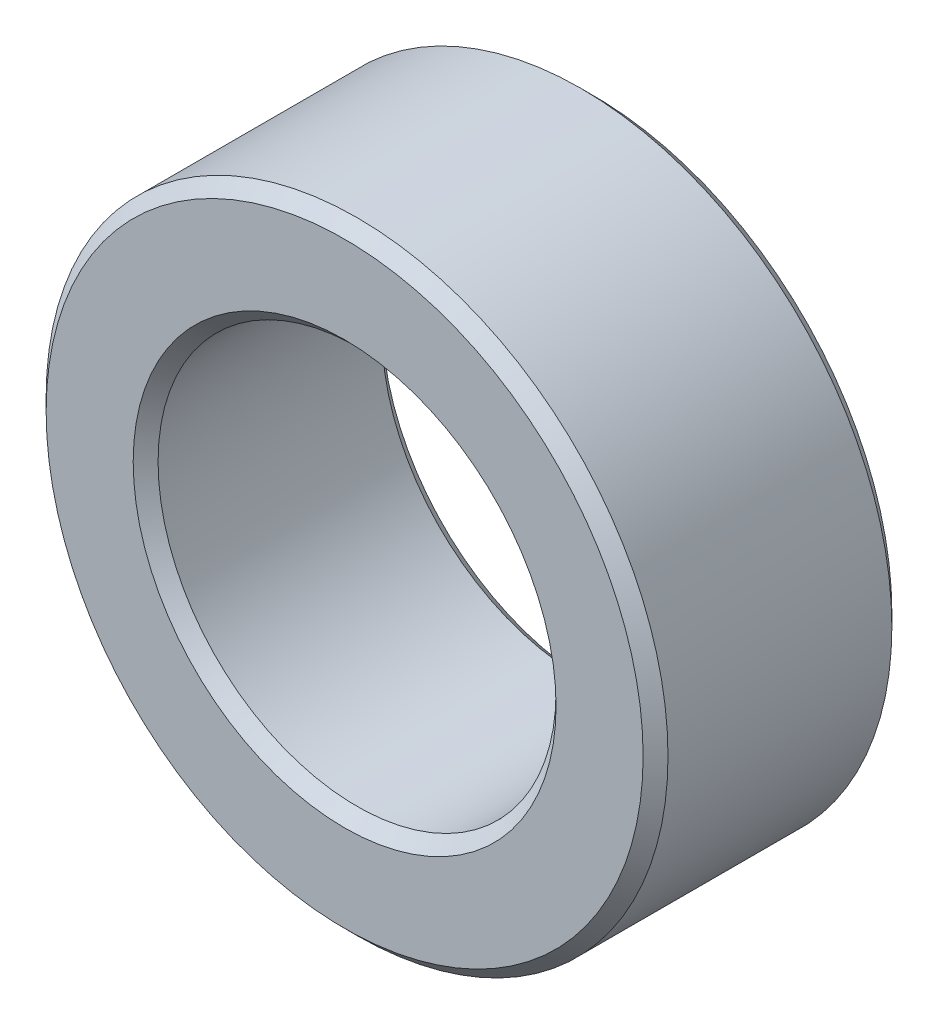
ISO-10303-21;
HEADER;
FILE_DESCRIPTION(('STEP AP214'),'2;1');
FILE_NAME('part.step','',(''),(''),'','','');
FILE_SCHEMA(('AUTOMOTIVE_DESIGN { 1 0 10303 214 1 1 1 1 }'));
ENDSEC;
DATA;
#1=APPLICATION_CONTEXT('core data for automotive mechanical design processes');
#2=APPLICATION_PROTOCOL_DEFINITION('international standard','automotive_design',2000,#1);
#3=PRODUCT_CONTEXT('',#1,'mechanical');
#4=PRODUCT('Part','Part','',(#3));
#5=PRODUCT_RELATED_PRODUCT_CATEGORY('part','',(#4));
#6=PRODUCT_DEFINITION_FORMATION('','',#4);
#7=PRODUCT_DEFINITION_CONTEXT('part definition',#1,'design');
#8=PRODUCT_DEFINITION('design','',#6,#7);
#9=PRODUCT_DEFINITION_SHAPE('','',#8);
#10=(LENGTH_UNIT() NAMED_UNIT(*) SI_UNIT(.MILLI.,.METRE.));
#11=(NAMED_UNIT(*) PLANE_ANGLE_UNIT() SI_UNIT($,.RADIAN.));
#12=(NAMED_UNIT(*) SI_UNIT($,.STERADIAN.) SOLID_ANGLE_UNIT());
#13=UNCERTAINTY_MEASURE_WITH_UNIT(LENGTH_MEASURE(1.E-05),#10,'distance_accuracy_value','');
#14=(GEOMETRIC_REPRESENTATION_CONTEXT(3) GLOBAL_UNCERTAINTY_ASSIGNED_CONTEXT((#13)) GLOBAL_UNIT_ASSIGNED_CONTEXT((#10,
#11,#12)) REPRESENTATION_CONTEXT('',''));
#15=CARTESIAN_POINT('',(0.,0.,0.));
#16=DIRECTION('',(0.,0.,1.));
#17=DIRECTION('',(1.,0.,0.));
#18=AXIS2_PLACEMENT_3D('',#15,#16,#17);
#19=CARTESIAN_POINT('',(0.,0.,2.));
#20=DIRECTION('',(0.,0.,1.));
#21=DIRECTION('',(1.,0.,0.));
#22=AXIS2_PLACEMENT_3D('',#19,#20,#21);
#23=PLANE('',#22);
#24=CARTESIAN_POINT('',(0.,0.,2.));
#25=DIRECTION('',(0.,0.,1.));
#26=DIRECTION('',(1.,0.,0.));
#27=AXIS2_PLACEMENT_3D('',#24,#25,#26);
#28=CIRCLE('',#27,3.4);
#29=CARTESIAN_POINT('',(3.4,0.,2.));
#30=VERTEX_POINT('',#29);
#31=EDGE_CURVE('E10',#30,#30,#28,.F.);
#32=ORIENTED_EDGE('',*,*,#31,.T.);
#33=EDGE_LOOP('',(#32));
#34=FACE_BOUND('',#33,.T.);
#35=CARTESIAN_POINT('',(0.,0.,2.));
#36=DIRECTION('',(0.,0.,1.));
#37=DIRECTION('',(1.,0.,0.));
#38=AXIS2_PLACEMENT_3D('',#35,#36,#37);
#39=CIRCLE('',#38,4.8);
#40=CARTESIAN_POINT('',(4.8,0.,2.));
#41=VERTEX_POINT('',#40);
#42=EDGE_CURVE('E45',#41,#41,#39,.T.);
#43=ORIENTED_EDGE('',*,*,#42,.T.);
#44=EDGE_LOOP('',(#43));
#45=FACE_BOUND('',#44,.T.);
#46=ADVANCED_FACE('F37',(#34,#45),#23,.T.);
#47=CARTESIAN_POINT('',(0.,0.,-2.));
#48=DIRECTION('',(0.,0.,1.));
#49=DIRECTION('',(1.,0.,0.));
#50=AXIS2_PLACEMENT_3D('',#47,#48,#49);
#51=PLANE('',#50);
#52=CARTESIAN_POINT('',(0.,0.,-2.));
#53=DIRECTION('',(0.,0.,1.));
#54=DIRECTION('',(1.,0.,0.));
#55=AXIS2_PLACEMENT_3D('',#52,#53,#54);
#56=CIRCLE('',#55,4.8);
#57=CARTESIAN_POINT('',(4.8,0.,-2.));
#58=VERTEX_POINT('',#57);
#59=EDGE_CURVE('E64',#58,#58,#56,.F.);
#60=ORIENTED_EDGE('',*,*,#59,.T.);
#61=EDGE_LOOP('',(#60));
#62=FACE_BOUND('',#61,.T.);
#63=CARTESIAN_POINT('',(0.,0.,-2.));
#64=DIRECTION('',(0.,0.,1.));
#65=DIRECTION('',(1.,0.,0.));
#66=AXIS2_PLACEMENT_3D('',#63,#64,#65);
#67=CIRCLE('',#66,3.4);
#68=CARTESIAN_POINT('',(3.4,0.,-2.));
#69=VERTEX_POINT('',#68);
#70=EDGE_CURVE('E67',#69,#69,#67,.T.);
#71=ORIENTED_EDGE('',*,*,#70,.T.);
#72=EDGE_LOOP('',(#71));
#73=FACE_BOUND('',#72,.T.);
#74=ADVANCED_FACE('F89',(#62,#73),#51,.F.);
#75=CARTESIAN_POINT('',(0.,0.,2.));
#76=DIRECTION('',(0.,0.,-1.));
#77=DIRECTION('',(-1.,0.,0.));
#78=AXIS2_PLACEMENT_3D('',#75,#76,#77);
#79=CYLINDRICAL_SURFACE('',#78,5.);
#80=CARTESIAN_POINT('',(0.,0.,-1.8));
#81=DIRECTION('',(0.,0.,1.));
#82=DIRECTION('',(1.,0.,0.));
#83=AXIS2_PLACEMENT_3D('',#80,#81,#82);
#84=CIRCLE('',#83,5.);
#85=CARTESIAN_POINT('',(5.,0.,-1.8));
#86=VERTEX_POINT('',#85);
#87=EDGE_CURVE('E71',#86,#86,#84,.T.);
#88=ORIENTED_EDGE('',*,*,#87,.T.);
#89=EDGE_LOOP('',(#88));
#90=FACE_BOUND('',#89,.T.);
#91=CARTESIAN_POINT('',(0.,0.,1.8));
#92=DIRECTION('',(0.,0.,1.));
#93=DIRECTION('',(1.,0.,0.));
#94=AXIS2_PLACEMENT_3D('',#91,#92,#93);
#95=CIRCLE('',#94,5.);
#96=CARTESIAN_POINT('',(5.,0.,1.8));
#97=VERTEX_POINT('',#96);
#98=EDGE_CURVE('E74',#97,#97,#95,.F.);
#99=ORIENTED_EDGE('',*,*,#98,.T.);
#100=EDGE_LOOP('',(#99));
#101=FACE_BOUND('',#100,.T.);
#102=ADVANCED_FACE('F78',(#90,#101),#79,.T.);
#103=CARTESIAN_POINT('',(0.,0.,2.));
#104=DIRECTION('',(0.,0.,-1.));
#105=DIRECTION('',(-1.,0.,0.));
#106=AXIS2_PLACEMENT_3D('',#103,#104,#105);
#107=CYLINDRICAL_SURFACE('',#106,3.2);
#108=CARTESIAN_POINT('',(0.,0.,-1.8));
#109=DIRECTION('',(0.,0.,1.));
#110=DIRECTION('',(1.,0.,0.));
#111=AXIS2_PLACEMENT_3D('',#108,#109,#110);
#112=CIRCLE('',#111,3.2);
#113=CARTESIAN_POINT('',(3.2,0.,-1.8));
#114=VERTEX_POINT('',#113);
#115=EDGE_CURVE('E52',#114,#114,#112,.F.);
#116=ORIENTED_EDGE('',*,*,#115,.T.);
#117=EDGE_LOOP('',(#116));
#118=FACE_BOUND('',#117,.T.);
#119=CARTESIAN_POINT('',(0.,0.,1.8));
#120=DIRECTION('',(0.,0.,1.));
#121=DIRECTION('',(1.,0.,0.));
#122=AXIS2_PLACEMENT_3D('',#119,#120,#121);
#123=CIRCLE('',#122,3.2);
#124=CARTESIAN_POINT('',(3.2,0.,1.8));
#125=VERTEX_POINT('',#124);
#126=EDGE_CURVE('E58',#125,#125,#123,.T.);
#127=ORIENTED_EDGE('',*,*,#126,.T.);
#128=EDGE_LOOP('',(#127));
#129=FACE_BOUND('',#128,.T.);
#130=ADVANCED_FACE('F97',(#118,#129),#107,.F.);
#131=CARTESIAN_POINT('',(0.,0.,-1.8));
#132=DIRECTION('',(0.,0.,1.));
#133=DIRECTION('',(1.,0.,0.));
#134=AXIS2_PLACEMENT_3D('',#131,#132,#133);
#135=CONICAL_SURFACE('',#134,5.,0.785398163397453);
#136=CARTESIAN_POINT('',(4.8,0.,-2.));
#137=CARTESIAN_POINT('',(4.80208333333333,0.,-1.99791666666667));
#138=CARTESIAN_POINT('',(4.80416666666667,0.,-1.99583333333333));
#139=CARTESIAN_POINT('',(4.80833333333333,0.,-1.99166666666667));
#140=CARTESIAN_POINT('',(4.81041666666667,0.,-1.98958333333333));
#141=CARTESIAN_POINT('',(4.81458333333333,0.,-1.98541666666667));
#142=CARTESIAN_POINT('',(4.81666666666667,0.,-1.98333333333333));
#143=CARTESIAN_POINT('',(4.82083333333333,0.,-1.97916666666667));
#144=CARTESIAN_POINT('',(4.82291666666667,0.,-1.97708333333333));
#145=CARTESIAN_POINT('',(4.82708333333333,0.,-1.97291666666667));
#146=CARTESIAN_POINT('',(4.82916666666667,0.,-1.97083333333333));
#147=CARTESIAN_POINT('',(4.83333333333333,0.,-1.96666666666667));
#148=CARTESIAN_POINT('',(4.83541666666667,0.,-1.96458333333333));
#149=CARTESIAN_POINT('',(4.83958333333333,0.,-1.96041666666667));
#150=CARTESIAN_POINT('',(4.84166666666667,0.,-1.95833333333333));
#151=CARTESIAN_POINT('',(4.84583333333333,0.,-1.95416666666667));
#152=CARTESIAN_POINT('',(4.84791666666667,0.,-1.95208333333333));
#153=CARTESIAN_POINT('',(4.85208333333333,0.,-1.94791666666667));
#154=CARTESIAN_POINT('',(4.85416666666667,0.,-1.94583333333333));
#155=CARTESIAN_POINT('',(4.85833333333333,0.,-1.94166666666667));
#156=CARTESIAN_POINT('',(4.86041666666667,0.,-1.93958333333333));
#157=CARTESIAN_POINT('',(4.86458333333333,0.,-1.93541666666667));
#158=CARTESIAN_POINT('',(4.86666666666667,0.,-1.93333333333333));
#159=CARTESIAN_POINT('',(4.87083333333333,0.,-1.92916666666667));
#160=CARTESIAN_POINT('',(4.87291666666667,0.,-1.92708333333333));
#161=CARTESIAN_POINT('',(4.87708333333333,0.,-1.92291666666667));
#162=CARTESIAN_POINT('',(4.87916666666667,0.,-1.92083333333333));
#163=CARTESIAN_POINT('',(4.88333333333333,0.,-1.91666666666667));
#164=CARTESIAN_POINT('',(4.88541666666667,0.,-1.91458333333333));
#165=CARTESIAN_POINT('',(4.88958333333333,0.,-1.91041666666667));
#166=CARTESIAN_POINT('',(4.89166666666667,0.,-1.90833333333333));
#167=CARTESIAN_POINT('',(4.89583333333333,0.,-1.90416666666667));
#168=CARTESIAN_POINT('',(4.89791666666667,0.,-1.90208333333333));
#169=CARTESIAN_POINT('',(4.90208333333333,0.,-1.89791666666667));
#170=CARTESIAN_POINT('',(4.90416666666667,0.,-1.89583333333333));
#171=CARTESIAN_POINT('',(4.90833333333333,0.,-1.89166666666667));
#172=CARTESIAN_POINT('',(4.91041666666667,0.,-1.88958333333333));
#173=CARTESIAN_POINT('',(4.91458333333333,0.,-1.88541666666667));
#174=CARTESIAN_POINT('',(4.91666666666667,0.,-1.88333333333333));
#175=CARTESIAN_POINT('',(4.92083333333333,0.,-1.87916666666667));
#176=CARTESIAN_POINT('',(4.92291666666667,0.,-1.87708333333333));
#177=CARTESIAN_POINT('',(4.92708333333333,0.,-1.87291666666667));
#178=CARTESIAN_POINT('',(4.92916666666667,0.,-1.87083333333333));
#179=CARTESIAN_POINT('',(4.93333333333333,0.,-1.86666666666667));
#180=CARTESIAN_POINT('',(4.93541666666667,0.,-1.86458333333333));
#181=CARTESIAN_POINT('',(4.93958333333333,0.,-1.86041666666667));
#182=CARTESIAN_POINT('',(4.94166666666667,0.,-1.85833333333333));
#183=CARTESIAN_POINT('',(4.94583333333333,0.,-1.85416666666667));
#184=CARTESIAN_POINT('',(4.94791666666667,0.,-1.85208333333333));
#185=CARTESIAN_POINT('',(4.95208333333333,0.,-1.84791666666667));
#186=CARTESIAN_POINT('',(4.95416666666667,0.,-1.84583333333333));
#187=CARTESIAN_POINT('',(4.95833333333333,0.,-1.84166666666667));
#188=CARTESIAN_POINT('',(4.96041666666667,0.,-1.83958333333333));
#189=CARTESIAN_POINT('',(4.96458333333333,0.,-1.83541666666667));
#190=CARTESIAN_POINT('',(4.96666666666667,0.,-1.83333333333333));
#191=CARTESIAN_POINT('',(4.97083333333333,0.,-1.82916666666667));
#192=CARTESIAN_POINT('',(4.97291666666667,0.,-1.82708333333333));
#193=CARTESIAN_POINT('',(4.97708333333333,0.,-1.82291666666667));
#194=CARTESIAN_POINT('',(4.97916666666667,0.,-1.82083333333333));
#195=CARTESIAN_POINT('',(4.98333333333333,0.,-1.81666666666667));
#196=CARTESIAN_POINT('',(4.98541666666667,0.,-1.81458333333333));
#197=CARTESIAN_POINT('',(4.98958333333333,0.,-1.81041666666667));
#198=CARTESIAN_POINT('',(4.99166666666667,0.,-1.80833333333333));
#199=CARTESIAN_POINT('',(4.99583333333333,0.,-1.80416666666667));
#200=CARTESIAN_POINT('',(4.99791666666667,0.,-1.80208333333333));
#201=CARTESIAN_POINT('',(5.,0.,-1.8));
#202=B_SPLINE_CURVE_WITH_KNOTS('',3,(#136,#137,#138,#139,#140,#141,#142,#143,#144,#145,#146,
#147,#148,#149,#150,#151,#152,#153,#154,#155,#156,#157,#158,#159,#160,#161,#162,#163,#164,#165,
#166,#167,#168,#169,#170,#171,#172,#173,#174,#175,#176,#177,#178,#179,#180,#181,#182,#183,#184,
#185,#186,#187,#188,#189,#190,#191,#192,#193,#194,#195,#196,#197,#198,#199,#200,#201),
.UNSPECIFIED.,.F.,.F.,(4,2,2,2,2,2,2,2,2,2,2,2,2,2,2,2,2,2,2,2,2,2,2,2,2,2,2,2,2,2,2,2,4),(0.,
0.00883883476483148,0.0176776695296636,0.0265165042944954,0.0353553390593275,0.0441941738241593,
0.0530330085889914,0.0618718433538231,0.0707106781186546,0.0795495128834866,0.0883883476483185,
0.0972271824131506,0.106066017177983,0.114904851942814,0.123743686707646,0.132582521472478,
0.14142135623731,0.150260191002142,0.159099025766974,0.167937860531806,0.176776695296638,
0.18561553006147,0.194454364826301,0.203293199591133,0.212132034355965,0.220970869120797,
0.229809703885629,0.238648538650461,0.247487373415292,0.256326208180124,0.265165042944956,
0.274003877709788,0.28284271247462),.UNSPECIFIED.);
#203=EDGE_CURVE('BSEAM102',#58,#86,#202,.T.);
#204=ORIENTED_EDGE('',*,*,#59,.F.);
#205=ORIENTED_EDGE('',*,*,#87,.F.);
#206=ORIENTED_EDGE('',*,*,#203,.T.);
#207=ORIENTED_EDGE('',*,*,#203,.F.);
#208=EDGE_LOOP('',(#204,#206,#205,#207));
#209=FACE_BOUND('',#208,.T.);
#210=ADVANCED_FACE('F102',(#209),#135,.T.);
#211=CARTESIAN_POINT('',(0.,0.,-2.));
#212=DIRECTION('',(0.,0.,-1.));
#213=DIRECTION('',(-1.,0.,0.));
#214=AXIS2_PLACEMENT_3D('',#211,#212,#213);
#215=CONICAL_SURFACE('',#214,3.4,0.785398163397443);
#216=ORIENTED_EDGE('',*,*,#115,.F.);
#217=EDGE_LOOP('',(#216));
#218=FACE_BOUND('',#217,.T.);
#219=ORIENTED_EDGE('',*,*,#70,.F.);
#220=EDGE_LOOP('',(#219));
#221=FACE_BOUND('',#220,.T.);
#222=ADVANCED_FACE('F86',(#218,#221),#215,.F.);
#223=CARTESIAN_POINT('',(0.,0.,1.8));
#224=DIRECTION('',(0.,0.,1.));
#225=DIRECTION('',(1.,0.,0.));
#226=AXIS2_PLACEMENT_3D('',#223,#224,#225);
#227=CONICAL_SURFACE('',#226,3.2,0.785398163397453);
#228=CARTESIAN_POINT('',(3.4,0.,2.));
#229=CARTESIAN_POINT('',(3.39791666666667,0.,1.99791666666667));
#230=CARTESIAN_POINT('',(3.39583333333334,0.,1.99583333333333));
#231=CARTESIAN_POINT('',(3.39166666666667,0.,1.99166666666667));
#232=CARTESIAN_POINT('',(3.38958333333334,0.,1.98958333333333));
#233=CARTESIAN_POINT('',(3.38541666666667,0.,1.98541666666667));
#234=CARTESIAN_POINT('',(3.38333333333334,0.,1.98333333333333));
#235=CARTESIAN_POINT('',(3.37916666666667,0.,1.97916666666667));
#236=CARTESIAN_POINT('',(3.37708333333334,0.,1.97708333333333));
#237=CARTESIAN_POINT('',(3.37291666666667,0.,1.97291666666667));
#238=CARTESIAN_POINT('',(3.37083333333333,0.,1.97083333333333));
#239=CARTESIAN_POINT('',(3.36666666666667,0.,1.96666666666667));
#240=CARTESIAN_POINT('',(3.36458333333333,0.,1.96458333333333));
#241=CARTESIAN_POINT('',(3.36041666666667,0.,1.96041666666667));
#242=CARTESIAN_POINT('',(3.35833333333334,0.,1.95833333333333));
#243=CARTESIAN_POINT('',(3.35416666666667,0.,1.95416666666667));
#244=CARTESIAN_POINT('',(3.35208333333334,0.,1.95208333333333));
#245=CARTESIAN_POINT('',(3.34791666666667,0.,1.94791666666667));
#246=CARTESIAN_POINT('',(3.34583333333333,0.,1.94583333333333));
#247=CARTESIAN_POINT('',(3.34166666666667,0.,1.94166666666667));
#248=CARTESIAN_POINT('',(3.33958333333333,0.,1.93958333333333));
#249=CARTESIAN_POINT('',(3.33541666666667,0.,1.93541666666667));
#250=CARTESIAN_POINT('',(3.33333333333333,0.,1.93333333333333));
#251=CARTESIAN_POINT('',(3.32916666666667,0.,1.92916666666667));
#252=CARTESIAN_POINT('',(3.32708333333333,0.,1.92708333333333));
#253=CARTESIAN_POINT('',(3.32291666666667,0.,1.92291666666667));
#254=CARTESIAN_POINT('',(3.32083333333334,0.,1.92083333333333));
#255=CARTESIAN_POINT('',(3.31666666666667,0.,1.91666666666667));
#256=CARTESIAN_POINT('',(3.31458333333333,0.,1.91458333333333));
#257=CARTESIAN_POINT('',(3.31041666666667,0.,1.91041666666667));
#258=CARTESIAN_POINT('',(3.30833333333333,0.,1.90833333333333));
#259=CARTESIAN_POINT('',(3.30416666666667,0.,1.90416666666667));
#260=CARTESIAN_POINT('',(3.30208333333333,0.,1.90208333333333));
#261=CARTESIAN_POINT('',(3.29791666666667,0.,1.89791666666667));
#262=CARTESIAN_POINT('',(3.29583333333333,0.,1.89583333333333));
#263=CARTESIAN_POINT('',(3.29166666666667,0.,1.89166666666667));
#264=CARTESIAN_POINT('',(3.28958333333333,0.,1.88958333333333));
#265=CARTESIAN_POINT('',(3.28541666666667,0.,1.88541666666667));
#266=CARTESIAN_POINT('',(3.28333333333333,0.,1.88333333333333));
#267=CARTESIAN_POINT('',(3.27916666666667,0.,1.87916666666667));
#268=CARTESIAN_POINT('',(3.27708333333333,0.,1.87708333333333));
#269=CARTESIAN_POINT('',(3.27291666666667,0.,1.87291666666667));
#270=CARTESIAN_POINT('',(3.27083333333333,0.,1.87083333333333));
#271=CARTESIAN_POINT('',(3.26666666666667,0.,1.86666666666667));
#272=CARTESIAN_POINT('',(3.26458333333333,0.,1.86458333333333));
#273=CARTESIAN_POINT('',(3.26041666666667,0.,1.86041666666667));
#274=CARTESIAN_POINT('',(3.25833333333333,0.,1.85833333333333));
#275=CARTESIAN_POINT('',(3.25416666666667,0.,1.85416666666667));
#276=CARTESIAN_POINT('',(3.25208333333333,0.,1.85208333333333));
#277=CARTESIAN_POINT('',(3.24791666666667,0.,1.84791666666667));
#278=CARTESIAN_POINT('',(3.24583333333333,0.,1.84583333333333));
#279=CARTESIAN_POINT('',(3.24166666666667,0.,1.84166666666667));
#280=CARTESIAN_POINT('',(3.23958333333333,0.,1.83958333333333));
#281=CARTESIAN_POINT('',(3.23541666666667,0.,1.83541666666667));
#282=CARTESIAN_POINT('',(3.23333333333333,0.,1.83333333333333));
#283=CARTESIAN_POINT('',(3.22916666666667,0.,1.82916666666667));
#284=CARTESIAN_POINT('',(3.22708333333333,0.,1.82708333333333));
#285=CARTESIAN_POINT('',(3.22291666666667,0.,1.82291666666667));
#286=CARTESIAN_POINT('',(3.22083333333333,0.,1.82083333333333));
#287=CARTESIAN_POINT('',(3.21666666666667,0.,1.81666666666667));
#288=CARTESIAN_POINT('',(3.21458333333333,0.,1.81458333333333));
#289=CARTESIAN_POINT('',(3.21041666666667,0.,1.81041666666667));
#290=CARTESIAN_POINT('',(3.20833333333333,0.,1.80833333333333));
#291=CARTESIAN_POINT('',(3.20416666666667,0.,1.80416666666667));
#292=CARTESIAN_POINT('',(3.20208333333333,0.,1.80208333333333));
#293=CARTESIAN_POINT('',(3.2,0.,1.8));
#294=B_SPLINE_CURVE_WITH_KNOTS('',3,(#228,#229,#230,#231,#232,#233,#234,#235,#236,#237,#238,
#239,#240,#241,#242,#243,#244,#245,#246,#247,#248,#249,#250,#251,#252,#253,#254,#255,#256,#257,
#258,#259,#260,#261,#262,#263,#264,#265,#266,#267,#268,#269,#270,#271,#272,#273,#274,#275,#276,
#277,#278,#279,#280,#281,#282,#283,#284,#285,#286,#287,#288,#289,#290,#291,#292,#293),
.UNSPECIFIED.,.F.,.F.,(4,2,2,2,2,2,2,2,2,2,2,2,2,2,2,2,2,2,2,2,2,2,2,2,2,2,2,2,2,2,2,2,4),(0.,
0.00883883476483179,0.0176776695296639,0.0265165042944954,0.0353553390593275,0.0441941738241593,
0.053033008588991,0.0618718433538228,0.0707106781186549,0.0795495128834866,0.0883883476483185,
0.0972271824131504,0.106066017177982,0.114904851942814,0.123743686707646,0.132582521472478,
0.14142135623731,0.150260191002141,0.159099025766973,0.167937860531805,0.176776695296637,
0.185615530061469,0.194454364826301,0.203293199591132,0.212132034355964,0.220970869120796,
0.229809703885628,0.23864853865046,0.247487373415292,0.256326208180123,0.265165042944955,
0.274003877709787,0.282842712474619),.UNSPECIFIED.);
#295=EDGE_CURVE('BSEAM82',#30,#125,#294,.T.);
#296=ORIENTED_EDGE('',*,*,#31,.F.);
#297=ORIENTED_EDGE('',*,*,#126,.F.);
#298=ORIENTED_EDGE('',*,*,#295,.T.);
#299=ORIENTED_EDGE('',*,*,#295,.F.);
#300=EDGE_LOOP('',(#296,#298,#297,#299));
#301=FACE_BOUND('',#300,.T.);
#302=ADVANCED_FACE('F82',(#301),#227,.F.);
#303=CARTESIAN_POINT('',(0.,0.,2.));
#304=DIRECTION('',(0.,0.,-1.));
#305=DIRECTION('',(-1.,0.,0.));
#306=AXIS2_PLACEMENT_3D('',#303,#304,#305);
#307=CONICAL_SURFACE('',#306,4.8,0.785398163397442);
#308=ORIENTED_EDGE('',*,*,#98,.F.);
#309=EDGE_LOOP('',(#308));
#310=FACE_BOUND('',#309,.T.);
#311=ORIENTED_EDGE('',*,*,#42,.F.);
#312=EDGE_LOOP('',(#311));
#313=FACE_BOUND('',#312,.T.);
#314=ADVANCED_FACE('F39',(#310,#313),#307,.T.);
#315=CLOSED_SHELL('',(#46,#74,#102,#130,#210,#222,#302,#314));
#316=MANIFOLD_SOLID_BREP('B2',#315);
#317=ADVANCED_BREP_SHAPE_REPRESENTATION('',(#18,#316),#14);
#318=SHAPE_DEFINITION_REPRESENTATION(#9,#317);
ENDSEC;
END-ISO-10303-21;
